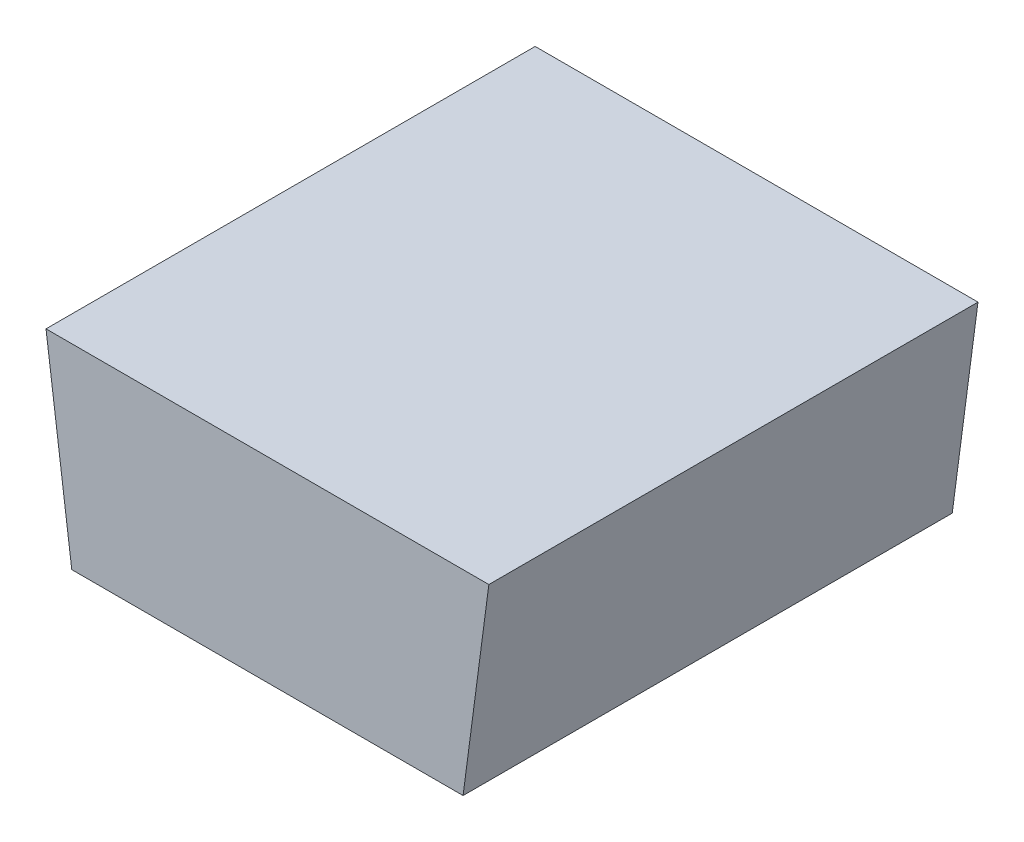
from build123d import *

# Parameters (mm, degrees)
EXTRUSION1_DEPTH = 50


with BuildPart() as part:
    # Esquisse1 → Extrusion1 (new body)
    with BuildSketch(Plane.XY):
        Polygon((-20, 0), (20, 0), (22.633049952, 20), (-22.633049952, 20), align=None)
    extrude(amount=EXTRUSION1_DEPTH)


solid = part.part
